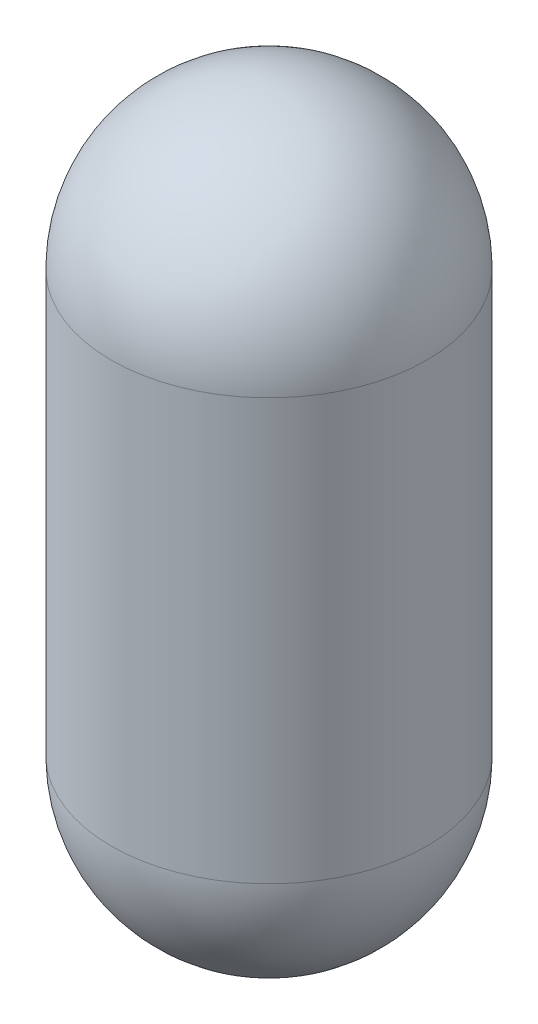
ISO-10303-21;
HEADER;
FILE_DESCRIPTION(('STEP AP214'),'2;1');
FILE_NAME('part.step','',(''),(''),'','','');
FILE_SCHEMA(('AUTOMOTIVE_DESIGN { 1 0 10303 214 1 1 1 1 }'));
ENDSEC;
DATA;
#1=APPLICATION_CONTEXT('core data for automotive mechanical design processes');
#2=APPLICATION_PROTOCOL_DEFINITION('international standard','automotive_design',2000,#1);
#3=PRODUCT_CONTEXT('',#1,'mechanical');
#4=PRODUCT('Part','Part','',(#3));
#5=PRODUCT_RELATED_PRODUCT_CATEGORY('part','',(#4));
#6=PRODUCT_DEFINITION_FORMATION('','',#4);
#7=PRODUCT_DEFINITION_CONTEXT('part definition',#1,'design');
#8=PRODUCT_DEFINITION('design','',#6,#7);
#9=PRODUCT_DEFINITION_SHAPE('','',#8);
#10=(LENGTH_UNIT() NAMED_UNIT(*) SI_UNIT(.MILLI.,.METRE.));
#11=(NAMED_UNIT(*) PLANE_ANGLE_UNIT() SI_UNIT($,.RADIAN.));
#12=(NAMED_UNIT(*) SI_UNIT($,.STERADIAN.) SOLID_ANGLE_UNIT());
#13=UNCERTAINTY_MEASURE_WITH_UNIT(LENGTH_MEASURE(1.E-05),#10,'distance_accuracy_value','');
#14=(GEOMETRIC_REPRESENTATION_CONTEXT(3) GLOBAL_UNCERTAINTY_ASSIGNED_CONTEXT((#13)) GLOBAL_UNIT_ASSIGNED_CONTEXT((#10,
#11,#12)) REPRESENTATION_CONTEXT('',''));
#15=CARTESIAN_POINT('',(0.,0.,0.));
#16=DIRECTION('',(0.,0.,1.));
#17=DIRECTION('',(1.,0.,0.));
#18=AXIS2_PLACEMENT_3D('',#15,#16,#17);
#19=CARTESIAN_POINT('',(-35.,-25.,0.));
#20=DIRECTION('',(0.,-1.,0.));
#21=DIRECTION('',(0.,0.,-1.));
#22=AXIS2_PLACEMENT_3D('',#19,#20,#21);
#23=CYLINDRICAL_SURFACE('',#22,1.5);
#24=CARTESIAN_POINT('',(-35.,-29.,0.));
#25=DIRECTION('',(0.,-1.,0.));
#26=DIRECTION('',(1.,0.,0.));
#27=AXIS2_PLACEMENT_3D('',#24,#25,#26);
#28=CIRCLE('',#27,1.5);
#29=CARTESIAN_POINT('',(-35.,-29.,-1.5));
#30=VERTEX_POINT('',#29);
#31=CARTESIAN_POINT('',(-35.,-29.,1.5));
#32=VERTEX_POINT('',#31);
#33=EDGE_CURVE('E11',#30,#32,#28,.T.);
#34=ORIENTED_EDGE('',*,*,#33,.F.);
#35=CARTESIAN_POINT('',(-35.,-29.,0.));
#36=DIRECTION('',(0.,1.,0.));
#37=DIRECTION('',(-1.,0.,0.));
#38=AXIS2_PLACEMENT_3D('',#35,#36,#37);
#39=CIRCLE('',#38,1.5);
#40=EDGE_CURVE('E24',#30,#32,#39,.T.);
#41=ORIENTED_EDGE('',*,*,#40,.T.);
#42=EDGE_LOOP('',(#34,#41));
#43=FACE_BOUND('',#42,.T.);
#44=CARTESIAN_POINT('',(-35.,-25.,0.));
#45=DIRECTION('',(0.,-1.,0.));
#46=DIRECTION('',(1.,0.,0.));
#47=AXIS2_PLACEMENT_3D('',#44,#45,#46);
#48=CIRCLE('',#47,1.5);
#49=CARTESIAN_POINT('',(-35.,-25.,-1.5));
#50=VERTEX_POINT('',#49);
#51=CARTESIAN_POINT('',(-35.,-25.,1.5));
#52=VERTEX_POINT('',#51);
#53=EDGE_CURVE('E41',#50,#52,#48,.T.);
#54=ORIENTED_EDGE('',*,*,#53,.T.);
#55=CARTESIAN_POINT('',(-35.,-25.,0.));
#56=DIRECTION('',(0.,1.,0.));
#57=DIRECTION('',(-1.,0.,0.));
#58=AXIS2_PLACEMENT_3D('',#55,#56,#57);
#59=CIRCLE('',#58,1.5);
#60=EDGE_CURVE('E30',#50,#52,#59,.T.);
#61=ORIENTED_EDGE('',*,*,#60,.F.);
#62=EDGE_LOOP('',(#54,#61));
#63=FACE_BOUND('',#62,.T.);
#64=ADVANCED_FACE('F16',(#43,#63),#23,.T.);
#65=CARTESIAN_POINT('',(-35.,-29.,0.));
#66=DIRECTION('',(0.,0.,1.));
#67=DIRECTION('',(1.,0.,0.));
#68=AXIS2_PLACEMENT_3D('',#65,#66,#67);
#69=SPHERICAL_SURFACE('',#68,1.5);
#70=CARTESIAN_POINT('',(-35.,-29.,0.));
#71=DIRECTION('',(0.,-1.,0.));
#72=DIRECTION('',(1.,0.,0.));
#73=AXIS2_PLACEMENT_3D('',#70,#71,#72);
#74=SPHERICAL_SURFACE('',#73,1.5);
#75=ORIENTED_EDGE('',*,*,#33,.T.);
#76=ORIENTED_EDGE('',*,*,#40,.F.);
#77=EDGE_LOOP('',(#75,#76));
#78=FACE_BOUND('',#77,.T.);
#79=ADVANCED_FACE('F62',(#78),#74,.T.);
#80=CARTESIAN_POINT('',(-35.,-25.,0.));
#81=DIRECTION('',(0.,0.,1.));
#82=DIRECTION('',(-1.,0.,0.));
#83=AXIS2_PLACEMENT_3D('',#80,#81,#82);
#84=SPHERICAL_SURFACE('',#83,1.5);
#85=CARTESIAN_POINT('',(-35.,-25.,0.));
#86=DIRECTION('',(0.,1.,0.));
#87=DIRECTION('',(-1.,0.,0.));
#88=AXIS2_PLACEMENT_3D('',#85,#86,#87);
#89=SPHERICAL_SURFACE('',#88,1.5);
#90=ORIENTED_EDGE('',*,*,#60,.T.);
#91=ORIENTED_EDGE('',*,*,#53,.F.);
#92=EDGE_LOOP('',(#90,#91));
#93=FACE_BOUND('',#92,.T.);
#94=ADVANCED_FACE('F44',(#93),#89,.T.);
#95=CLOSED_SHELL('',(#64,#79,#94));
#96=MANIFOLD_SOLID_BREP('B1',#95);
#97=ADVANCED_BREP_SHAPE_REPRESENTATION('',(#18,#96),#14);
#98=SHAPE_DEFINITION_REPRESENTATION(#9,#97);
ENDSEC;
END-ISO-10303-21;
